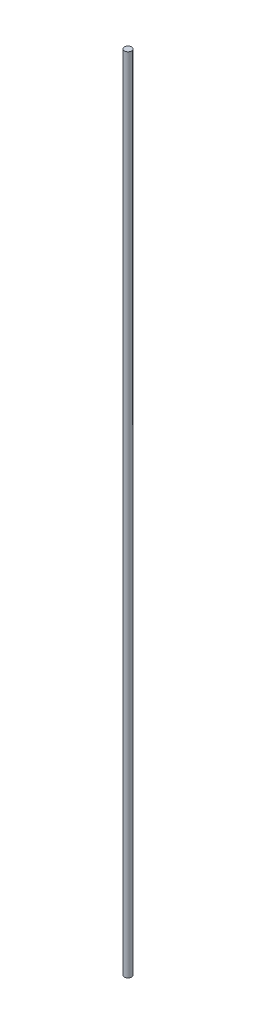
ISO-10303-21;
HEADER;
FILE_DESCRIPTION(('STEP AP214'),'2;1');
FILE_NAME('part.step','',(''),(''),'','','');
FILE_SCHEMA(('AUTOMOTIVE_DESIGN { 1 0 10303 214 1 1 1 1 }'));
ENDSEC;
DATA;
#1=APPLICATION_CONTEXT('core data for automotive mechanical design processes');
#2=APPLICATION_PROTOCOL_DEFINITION('international standard','automotive_design',2000,#1);
#3=PRODUCT_CONTEXT('',#1,'mechanical');
#4=PRODUCT('Part','Part','',(#3));
#5=PRODUCT_RELATED_PRODUCT_CATEGORY('part','',(#4));
#6=PRODUCT_DEFINITION_FORMATION('','',#4);
#7=PRODUCT_DEFINITION_CONTEXT('part definition',#1,'design');
#8=PRODUCT_DEFINITION('design','',#6,#7);
#9=PRODUCT_DEFINITION_SHAPE('','',#8);
#10=(LENGTH_UNIT() NAMED_UNIT(*) SI_UNIT(.MILLI.,.METRE.));
#11=(NAMED_UNIT(*) PLANE_ANGLE_UNIT() SI_UNIT($,.RADIAN.));
#12=(NAMED_UNIT(*) SI_UNIT($,.STERADIAN.) SOLID_ANGLE_UNIT());
#13=UNCERTAINTY_MEASURE_WITH_UNIT(LENGTH_MEASURE(1.E-05),#10,'distance_accuracy_value','');
#14=(GEOMETRIC_REPRESENTATION_CONTEXT(3) GLOBAL_UNCERTAINTY_ASSIGNED_CONTEXT((#13)) GLOBAL_UNIT_ASSIGNED_CONTEXT((#10,
#11,#12)) REPRESENTATION_CONTEXT('',''));
#15=CARTESIAN_POINT('',(0.,0.,0.));
#16=DIRECTION('',(0.,0.,1.));
#17=DIRECTION('',(1.,0.,0.));
#18=AXIS2_PLACEMENT_3D('',#15,#16,#17);
#19=CARTESIAN_POINT('',(0.,900.,0.));
#20=DIRECTION('',(0.,-1.,0.));
#21=DIRECTION('',(0.,0.,-1.));
#22=AXIS2_PLACEMENT_3D('',#19,#20,#21);
#23=CYLINDRICAL_SURFACE('',#22,4.);
#24=CARTESIAN_POINT('',(0.,900.,0.));
#25=DIRECTION('',(0.,1.,0.));
#26=DIRECTION('',(0.,0.,1.));
#27=AXIS2_PLACEMENT_3D('',#24,#25,#26);
#28=CIRCLE('',#27,4.);
#29=CARTESIAN_POINT('',(0.,900.,4.));
#30=VERTEX_POINT('',#29);
#31=EDGE_CURVE('E10',#30,#30,#28,.T.);
#32=ORIENTED_EDGE('',*,*,#31,.F.);
#33=EDGE_LOOP('',(#32));
#34=FACE_BOUND('',#33,.T.);
#35=CARTESIAN_POINT('',(0.,0.,0.));
#36=DIRECTION('',(0.,1.,0.));
#37=DIRECTION('',(0.,0.,1.));
#38=AXIS2_PLACEMENT_3D('',#35,#36,#37);
#39=CIRCLE('',#38,4.);
#40=CARTESIAN_POINT('',(0.,0.,4.));
#41=VERTEX_POINT('',#40);
#42=EDGE_CURVE('E38',#41,#41,#39,.T.);
#43=ORIENTED_EDGE('',*,*,#42,.T.);
#44=EDGE_LOOP('',(#43));
#45=FACE_BOUND('',#44,.T.);
#46=ADVANCED_FACE('F35',(#34,#45),#23,.T.);
#47=CARTESIAN_POINT('',(0.,900.,0.));
#48=DIRECTION('',(0.,1.,0.));
#49=DIRECTION('',(0.,0.,1.));
#50=AXIS2_PLACEMENT_3D('',#47,#48,#49);
#51=PLANE('',#50);
#52=ORIENTED_EDGE('',*,*,#31,.T.);
#53=EDGE_LOOP('',(#52));
#54=FACE_BOUND('',#53,.T.);
#55=ADVANCED_FACE('F50',(#54),#51,.T.);
#56=CARTESIAN_POINT('',(0.,0.,0.));
#57=DIRECTION('',(0.,1.,0.));
#58=DIRECTION('',(0.,0.,1.));
#59=AXIS2_PLACEMENT_3D('',#56,#57,#58);
#60=PLANE('',#59);
#61=ORIENTED_EDGE('',*,*,#42,.F.);
#62=EDGE_LOOP('',(#61));
#63=FACE_BOUND('',#62,.T.);
#64=ADVANCED_FACE('F48',(#63),#60,.F.);
#65=CLOSED_SHELL('',(#46,#55,#64));
#66=MANIFOLD_SOLID_BREP('B2',#65);
#67=ADVANCED_BREP_SHAPE_REPRESENTATION('',(#18,#66),#14);
#68=SHAPE_DEFINITION_REPRESENTATION(#9,#67);
ENDSEC;
END-ISO-10303-21;
